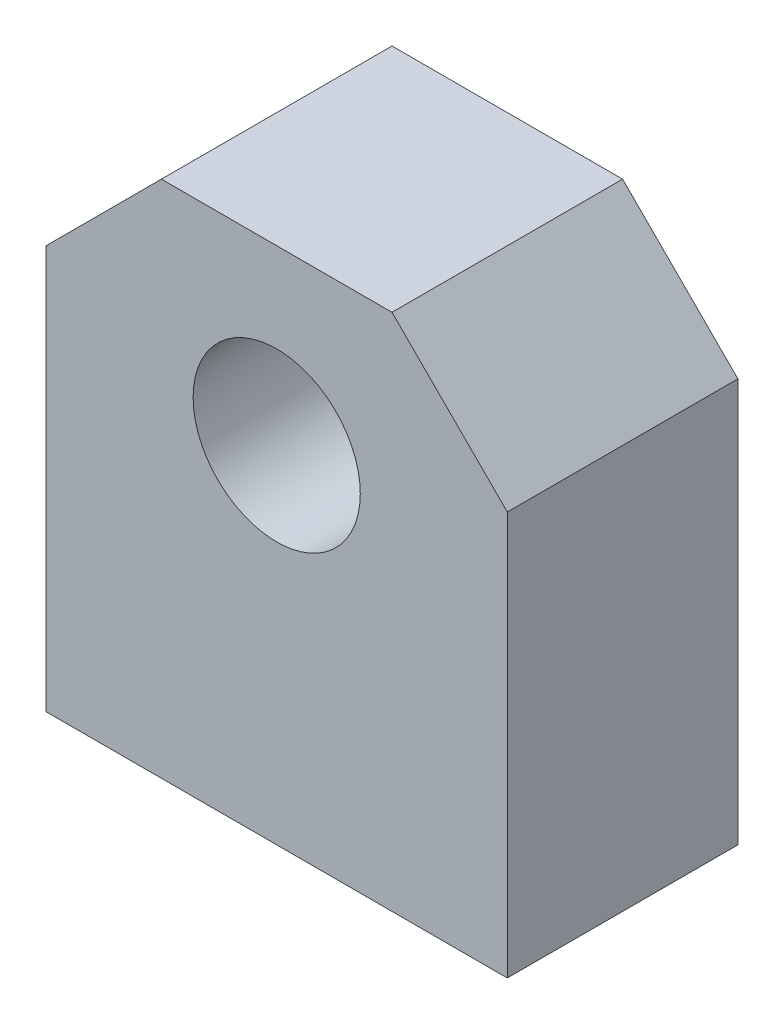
from build123d import *

# Parameters (mm, degrees)
ESQUISSE1_R           = 7.25
EXTRUSION1_DEPTH      = 20
TROU_TARAUD_M61_D     = 5
TROU_TARAUD_M61_DEPTH = 25
TROU_TARAUD_M61_TIP   = 1.502151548


with BuildPart() as part:
    # Esquisse1 → Extrusion1 (new body)
    with BuildSketch(Plane.XY):
        Polygon((10, 15), (20, 5), (20, -30), (-20, -30), (-20, 5), (-10, 15), align=None)
        Circle(ESQUISSE1_R, mode=Mode.SUBTRACT)
    extrude(amount=EXTRUSION1_DEPTH)

    # Trou taraud_ M61
    with Locations(Plane(origin=(10, -30, 10), x_dir=(0, 0, -1), z_dir=(0, -1, 0))):
        with Locations((0, 0), (0, -20)):
            Hole(TROU_TARAUD_M61_D / 2, depth=TROU_TARAUD_M61_DEPTH)
            with Locations((0, 0, -(TROU_TARAUD_M61_DEPTH + TROU_TARAUD_M61_TIP / 2))):  # 118° drill point
                Cone(0, TROU_TARAUD_M61_D / 2, TROU_TARAUD_M61_TIP, mode=Mode.SUBTRACT)


solid = part.part
